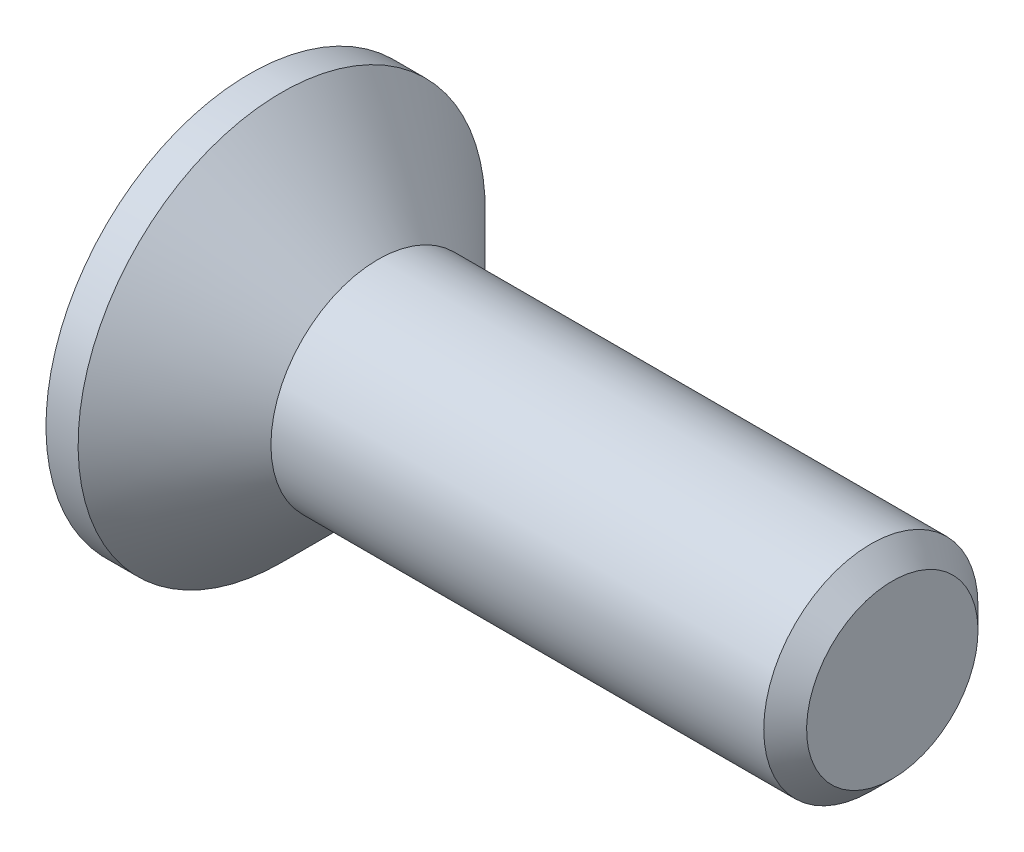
from build123d import *

# Parameters (mm, degrees)
CHAMFER1_SIZE      = 0.2
CUT_EXTRUDE1_DEPTH = 0.95


with BuildPart() as part:
    # Sketch1 → Revolve1 (revolve)
    with BuildSketch(Plane.XY, mode=Mode.PRIVATE) as revolve1_sk:
        Polygon((-1.2, 1.9), (-1.2, 0), (4.8, 0), (4.8, 1), (0, 1), (-0.9, 1.9), align=None)
    revolve(revolve1_sk.sketch.rotate(Axis((-1.2, 0, 0), (1, 0, 0)), 180), axis=Axis((-1.2, 0, 0), (1, 0, 0)))

    # Chamfer1
    chamfer1_edges = [part.edges().sort_by_distance(p)[0] for p in [
        (4.8, 1, 0),
    ]]
    chamfer(chamfer1_edges, length=CHAMFER1_SIZE)

    # Sketch2 → Cut-Extrude1 (cut)
    with BuildSketch(Plane.ZY.offset(1.2)):
        Polygon((-0.3, 1.175), (0.3, 1.175), (0.3, 0.3), (1.175, 0.3), (1.175, -0.3), (0.3, -0.3), (0.3, -1.175), (-0.3, -1.175), (-0.3, -0.3), (-1.175, -0.3), (-1.175, 0.3), (-0.3, 0.3), align=None)
    extrude(amount=-CUT_EXTRUDE1_DEPTH, mode=Mode.SUBTRACT)


solid = part.part
